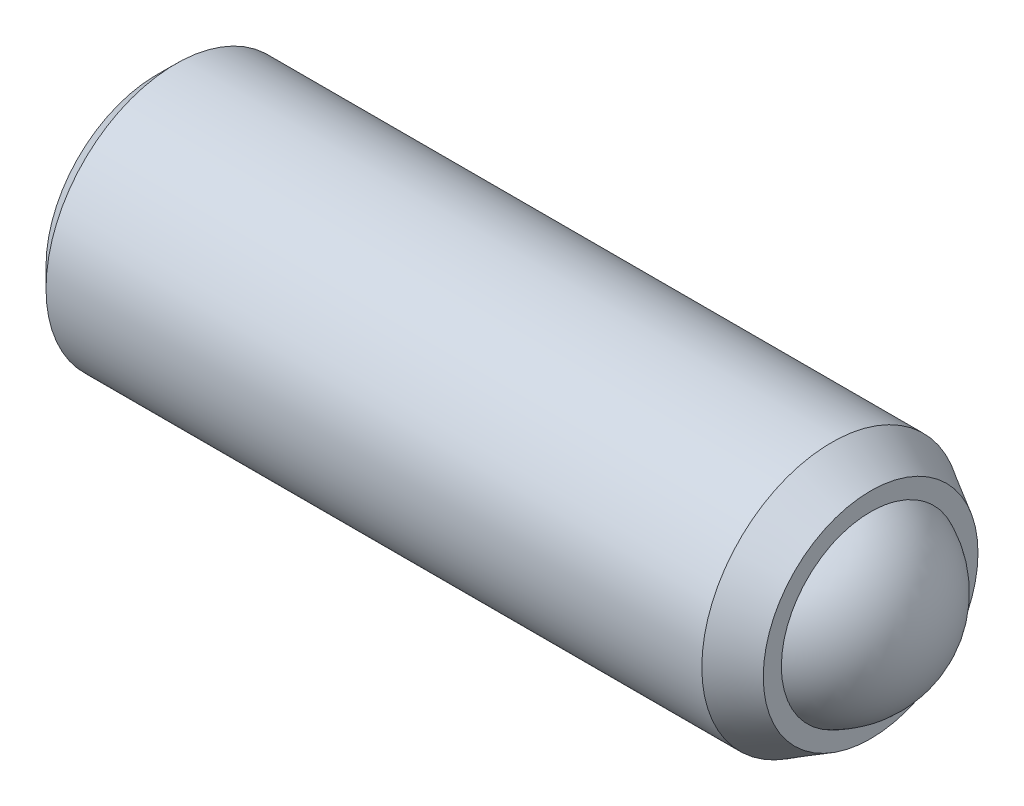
ISO-10303-21;
HEADER;
FILE_DESCRIPTION(('STEP AP214'),'2;1');
FILE_NAME('part.step','',(''),(''),'','','');
FILE_SCHEMA(('AUTOMOTIVE_DESIGN { 1 0 10303 214 1 1 1 1 }'));
ENDSEC;
DATA;
#1=APPLICATION_CONTEXT('core data for automotive mechanical design processes');
#2=APPLICATION_PROTOCOL_DEFINITION('international standard','automotive_design',2000,#1);
#3=PRODUCT_CONTEXT('',#1,'mechanical');
#4=PRODUCT('Part','Part','',(#3));
#5=PRODUCT_RELATED_PRODUCT_CATEGORY('part','',(#4));
#6=PRODUCT_DEFINITION_FORMATION('','',#4);
#7=PRODUCT_DEFINITION_CONTEXT('part definition',#1,'design');
#8=PRODUCT_DEFINITION('design','',#6,#7);
#9=PRODUCT_DEFINITION_SHAPE('','',#8);
#10=(LENGTH_UNIT() NAMED_UNIT(*) SI_UNIT(.MILLI.,.METRE.));
#11=(NAMED_UNIT(*) PLANE_ANGLE_UNIT() SI_UNIT($,.RADIAN.));
#12=(NAMED_UNIT(*) SI_UNIT($,.STERADIAN.) SOLID_ANGLE_UNIT());
#13=UNCERTAINTY_MEASURE_WITH_UNIT(LENGTH_MEASURE(1.E-05),#10,'distance_accuracy_value','');
#14=(GEOMETRIC_REPRESENTATION_CONTEXT(3) GLOBAL_UNCERTAINTY_ASSIGNED_CONTEXT((#13)) GLOBAL_UNIT_ASSIGNED_CONTEXT((#10,
#11,#12)) REPRESENTATION_CONTEXT('',''));
#15=CARTESIAN_POINT('',(0.,0.,0.));
#16=DIRECTION('',(0.,0.,1.));
#17=DIRECTION('',(1.,0.,0.));
#18=AXIS2_PLACEMENT_3D('',#15,#16,#17);
#19=CARTESIAN_POINT('',(10.4,0.,0.));
#20=DIRECTION('',(0.,-1.,0.));
#21=DIRECTION('',(-1.,0.,0.));
#22=AXIS2_PLACEMENT_3D('',#19,#20,#21);
#23=SPHERICAL_SURFACE('',#22,1.5);
#24=CARTESIAN_POINT('',(10.4,-1.5,0.));
#25=VERTEX_POINT('',#24);
#26=VERTEX_LOOP('',#25);
#27=FACE_BOUND('',#26,.T.);
#28=ADVANCED_FACE('P0_F11',(#27),#23,.T.);
#29=CLOSED_SHELL('',(#28));
#30=MANIFOLD_SOLID_BREP('P0_B1',#29);
#31=CARTESIAN_POINT('',(0.,0.,0.));
#32=DIRECTION('',(1.,0.,0.));
#33=DIRECTION('',(0.,0.,-1.));
#34=AXIS2_PLACEMENT_3D('',#31,#32,#33);
#35=PLANE('',#34);
#36=CARTESIAN_POINT('',(0.,0.,0.));
#37=DIRECTION('',(-1.,0.,0.));
#38=DIRECTION('',(0.,0.,1.));
#39=AXIS2_PLACEMENT_3D('',#36,#37,#38);
#40=CIRCLE('',#39,1.7);
#41=CARTESIAN_POINT('',(0.,0.,1.7));
#42=VERTEX_POINT('',#41);
#43=EDGE_CURVE('P1_E10',#42,#42,#40,.T.);
#44=ORIENTED_EDGE('',*,*,#43,.T.);
#45=EDGE_LOOP('',(#44));
#46=FACE_BOUND('',#45,.T.);
#47=ADVANCED_FACE('P1_F15',(#46),#35,.F.);
#48=CARTESIAN_POINT('',(0.3,0.,0.));
#49=DIRECTION('',(1.,0.,0.));
#50=DIRECTION('',(0.,0.,-1.));
#51=AXIS2_PLACEMENT_3D('',#48,#49,#50);
#52=CONICAL_SURFACE('',#51,2.,0.785398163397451);
#53=ORIENTED_EDGE('',*,*,#43,.F.);
#54=EDGE_LOOP('',(#53));
#55=FACE_BOUND('',#54,.T.);
#56=CARTESIAN_POINT('',(0.3,0.,0.));
#57=DIRECTION('',(-1.,0.,0.));
#58=DIRECTION('',(0.,0.,1.));
#59=AXIS2_PLACEMENT_3D('',#56,#57,#58);
#60=CIRCLE('',#59,2.);
#61=CARTESIAN_POINT('',(0.3,0.,2.));
#62=VERTEX_POINT('',#61);
#63=EDGE_CURVE('P1_E21',#62,#62,#60,.T.);
#64=ORIENTED_EDGE('',*,*,#63,.T.);
#65=EDGE_LOOP('',(#64));
#66=FACE_BOUND('',#65,.T.);
#67=ADVANCED_FACE('P1_F39',(#55,#66),#52,.T.);
#68=CARTESIAN_POINT('',(0.,0.,0.));
#69=DIRECTION('',(-1.,0.,0.));
#70=DIRECTION('',(0.,0.,1.));
#71=AXIS2_PLACEMENT_3D('',#68,#69,#70);
#72=CYLINDRICAL_SURFACE('',#71,2.);
#73=ORIENTED_EDGE('',*,*,#63,.F.);
#74=EDGE_LOOP('',(#73));
#75=FACE_BOUND('',#74,.T.);
#76=CARTESIAN_POINT('',(10.4,0.,0.));
#77=DIRECTION('',(-1.,0.,0.));
#78=DIRECTION('',(0.,0.,1.));
#79=AXIS2_PLACEMENT_3D('',#76,#77,#78);
#80=CIRCLE('',#79,2.);
#81=CARTESIAN_POINT('',(10.4,0.,2.));
#82=VERTEX_POINT('',#81);
#83=EDGE_CURVE('P1_E52',#82,#82,#80,.T.);
#84=ORIENTED_EDGE('',*,*,#83,.T.);
#85=EDGE_LOOP('',(#84));
#86=FACE_BOUND('',#85,.T.);
#87=ADVANCED_FACE('P1_F45',(#75,#86),#72,.T.);
#88=CARTESIAN_POINT('',(11.,0.,0.));
#89=DIRECTION('',(-1.,0.,0.));
#90=DIRECTION('',(0.,0.,1.));
#91=AXIS2_PLACEMENT_3D('',#88,#89,#90);
#92=CONICAL_SURFACE('',#91,1.65358983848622,0.5235987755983);
#93=ORIENTED_EDGE('',*,*,#83,.F.);
#94=EDGE_LOOP('',(#93));
#95=FACE_BOUND('',#94,.T.);
#96=CARTESIAN_POINT('',(11.,0.,0.));
#97=DIRECTION('',(-1.,0.,0.));
#98=DIRECTION('',(0.,0.,1.));
#99=AXIS2_PLACEMENT_3D('',#96,#97,#98);
#100=CIRCLE('',#99,1.65358983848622);
#101=CARTESIAN_POINT('',(11.,0.,1.65358983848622));
#102=VERTEX_POINT('',#101);
#103=EDGE_CURVE('P1_E54',#102,#102,#100,.T.);
#104=ORIENTED_EDGE('',*,*,#103,.T.);
#105=EDGE_LOOP('',(#104));
#106=FACE_BOUND('',#105,.T.);
#107=ADVANCED_FACE('P1_F78',(#95,#106),#92,.T.);
#108=CARTESIAN_POINT('',(11.,1.65358983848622,0.));
#109=DIRECTION('',(-1.,0.,0.));
#110=DIRECTION('',(0.,0.,1.));
#111=AXIS2_PLACEMENT_3D('',#108,#109,#110);
#112=PLANE('',#111);
#113=ORIENTED_EDGE('',*,*,#103,.F.);
#114=EDGE_LOOP('',(#113));
#115=FACE_BOUND('',#114,.T.);
#116=CARTESIAN_POINT('',(11.,0.,0.));
#117=DIRECTION('',(-1.,0.,0.));
#118=DIRECTION('',(0.,0.,1.));
#119=AXIS2_PLACEMENT_3D('',#116,#117,#118);
#120=CIRCLE('',#119,1.37477270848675);
#121=CARTESIAN_POINT('',(11.,0.,1.37477270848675));
#122=VERTEX_POINT('',#121);
#123=EDGE_CURVE('P1_E59',#122,#122,#120,.T.);
#124=ORIENTED_EDGE('',*,*,#123,.T.);
#125=EDGE_LOOP('',(#124));
#126=FACE_BOUND('',#125,.T.);
#127=ADVANCED_FACE('P1_F71',(#115,#126),#112,.F.);
#128=CARTESIAN_POINT('',(10.4,0.,0.));
#129=DIRECTION('',(-1.,0.,0.));
#130=DIRECTION('',(0.,1.,0.));
#131=AXIS2_PLACEMENT_3D('',#128,#129,#130);
#132=SPHERICAL_SURFACE('',#131,1.5);
#133=ORIENTED_EDGE('',*,*,#123,.F.);
#134=EDGE_LOOP('',(#133));
#135=FACE_BOUND('',#134,.T.);
#136=CARTESIAN_POINT('',(10.4,0.,0.));
#137=DIRECTION('',(-1.,0.,0.));
#138=DIRECTION('',(0.,0.,1.));
#139=AXIS2_PLACEMENT_3D('',#136,#137,#138);
#140=CIRCLE('',#139,1.5);
#141=CARTESIAN_POINT('',(10.4,0.,1.5));
#142=VERTEX_POINT('',#141);
#143=EDGE_CURVE('P1_E62',#142,#142,#140,.T.);
#144=ORIENTED_EDGE('',*,*,#143,.T.);
#145=EDGE_LOOP('',(#144));
#146=FACE_BOUND('',#145,.T.);
#147=ADVANCED_FACE('P1_F34',(#135,#146),#132,.F.);
#148=CARTESIAN_POINT('',(0.,0.,0.));
#149=DIRECTION('',(-1.,0.,0.));
#150=DIRECTION('',(0.,0.,1.));
#151=AXIS2_PLACEMENT_3D('',#148,#149,#150);
#152=CYLINDRICAL_SURFACE('',#151,1.5);
#153=ORIENTED_EDGE('',*,*,#143,.F.);
#154=EDGE_LOOP('',(#153));
#155=FACE_BOUND('',#154,.T.);
#156=CARTESIAN_POINT('',(2.11602540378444,0.,0.));
#157=DIRECTION('',(-1.,0.,0.));
#158=DIRECTION('',(0.,0.,1.));
#159=AXIS2_PLACEMENT_3D('',#156,#157,#158);
#160=CIRCLE('',#159,1.5);
#161=CARTESIAN_POINT('',(2.11602540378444,0.,1.5));
#162=VERTEX_POINT('',#161);
#163=EDGE_CURVE('P1_E65',#162,#162,#160,.T.);
#164=ORIENTED_EDGE('',*,*,#163,.T.);
#165=EDGE_LOOP('',(#164));
#166=FACE_BOUND('',#165,.T.);
#167=ADVANCED_FACE('P1_F26',(#155,#166),#152,.F.);
#168=CARTESIAN_POINT('',(1.25,0.,0.));
#169=DIRECTION('',(1.,0.,0.));
#170=DIRECTION('',(0.,0.,-1.));
#171=AXIS2_PLACEMENT_3D('',#168,#169,#170);
#172=CONICAL_SURFACE('',#171,0.,1.0471975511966);
#173=ORIENTED_EDGE('',*,*,#163,.F.);
#174=EDGE_LOOP('',(#173));
#175=FACE_BOUND('',#174,.T.);
#176=CARTESIAN_POINT('',(1.25,0.,0.));
#177=VERTEX_POINT('',#176);
#178=VERTEX_LOOP('',#177);
#179=FACE_BOUND('',#178,.T.);
#180=ADVANCED_FACE('P1_F24',(#175,#179),#172,.F.);
#181=CLOSED_SHELL('',(#47,#67,#87,#107,#127,#147,#167,#180));
#182=MANIFOLD_SOLID_BREP('P1_B1',#181);
#183=ADVANCED_BREP_SHAPE_REPRESENTATION('',(#18,#30,#182),#14);
#184=SHAPE_DEFINITION_REPRESENTATION(#9,#183);
ENDSEC;
END-ISO-10303-21;
